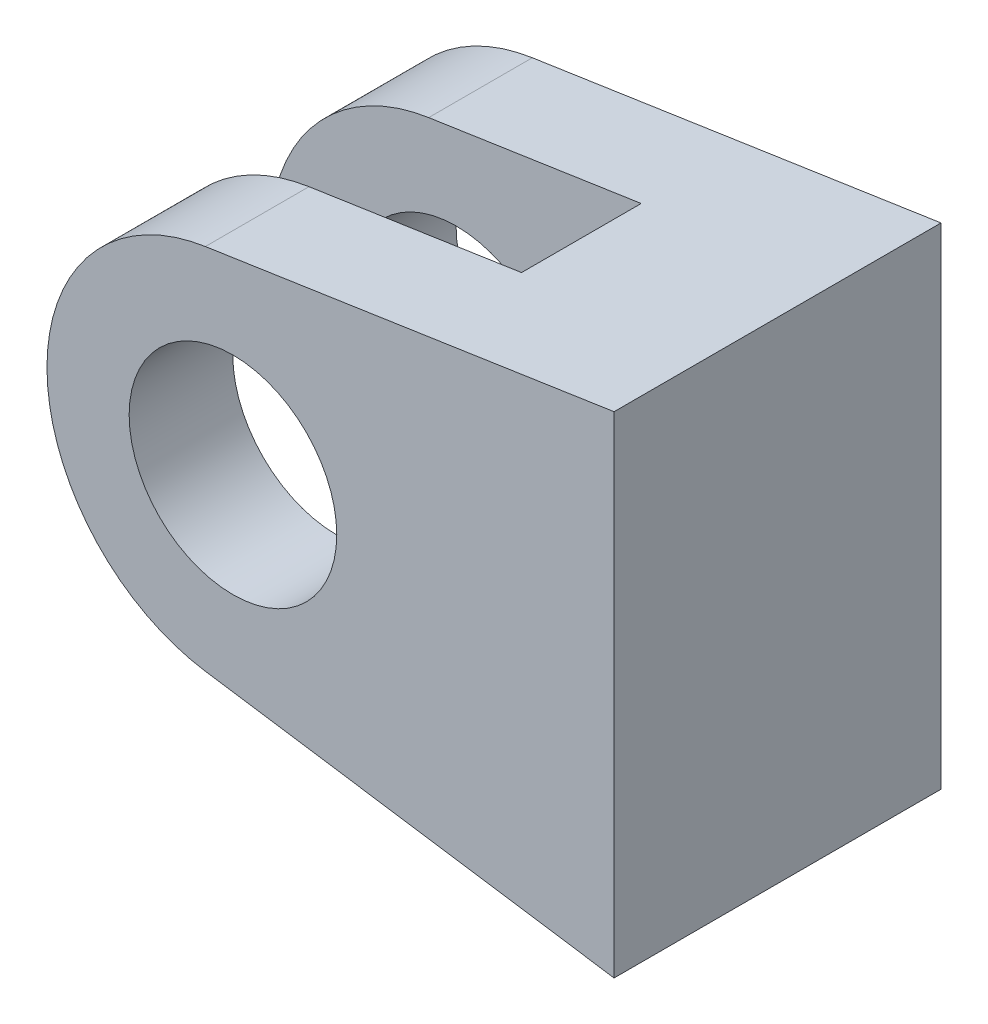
from build123d import *

# Parameters (mm, degrees)
SKETCH1_R               = 6.35
EXTRUDE1_DEPTH          = 20
CUT_EXTRUDE1_DEPTH      = 99.986932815
CUT_EXTRUDE1_DEPTH_BACK = 99.986932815
SKETCH2_W               = 24.345980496
SKETCH2_H               = 7.32


with BuildPart() as part:
    # Sketch1 → Extrude1 (new body)
    with BuildSketch(Plane.XY):
        with BuildLine():
            Line((94.230085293, 7.2161484), (94.230085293, -22.7838516))
            Line((94.230085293, -22.7838516), (69.230085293, -19.0338516))
            ThreePointArc((69.230085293, -19.0338516), (59.541726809, -7.7838516), (69.230085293, 3.4661484))
            Line((69.230085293, 3.4661484), (94.230085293, 7.2161484))
        make_face()
        with Locations((70.917585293, -7.7838516)):
            Circle(SKETCH1_R, mode=Mode.SUBTRACT)
    extrude(amount=EXTRUDE1_DEPTH)

    # Sketch2 → Cut-Extrude1 (cut, two sides: drawn at the far end of the back side and taken through both)
    with BuildSketch(Plane(origin=(0, 0, 0), x_dir=(1, 0, 0), z_dir=(0, 1, 0)).offset(-CUT_EXTRUDE1_DEPTH_BACK)):
        with Locations((70.057095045, -10)):
            Rectangle(SKETCH2_W, SKETCH2_H)
    extrude(amount=CUT_EXTRUDE1_DEPTH + CUT_EXTRUDE1_DEPTH_BACK, mode=Mode.SUBTRACT)


solid = part.part
